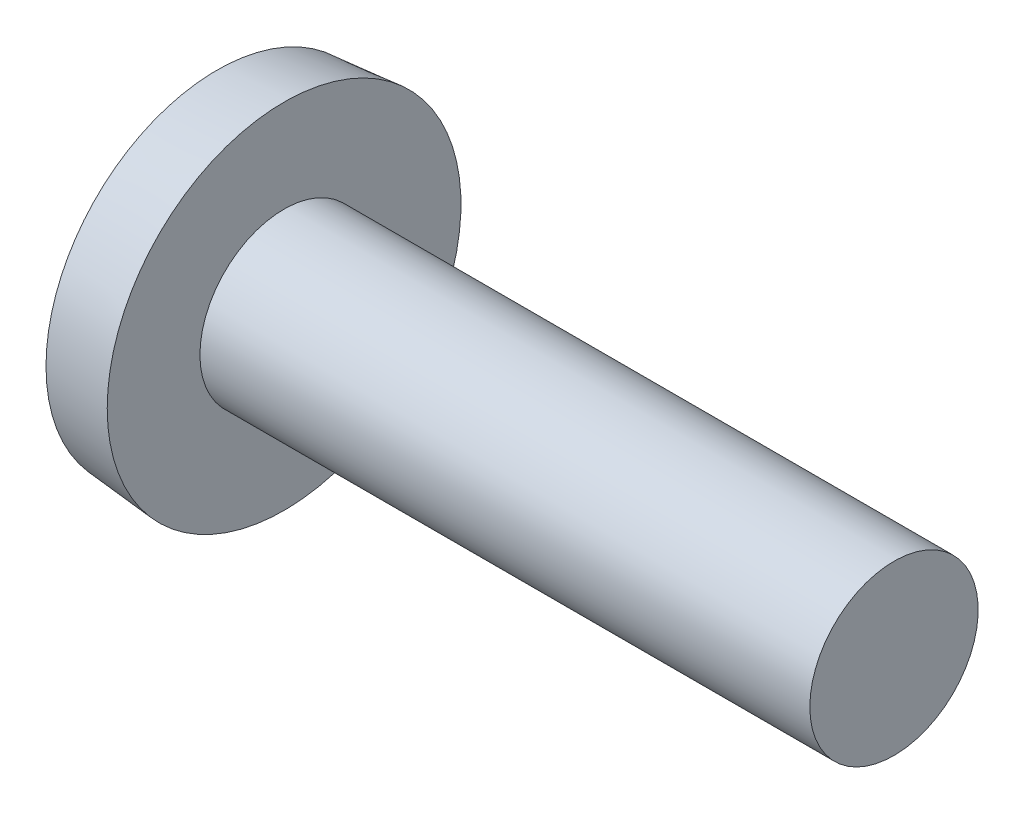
ISO-10303-21;
HEADER;
FILE_DESCRIPTION(('STEP AP214'),'2;1');
FILE_NAME('part.step','',(''),(''),'','','');
FILE_SCHEMA(('AUTOMOTIVE_DESIGN { 1 0 10303 214 1 1 1 1 }'));
ENDSEC;
DATA;
#1=APPLICATION_CONTEXT('core data for automotive mechanical design processes');
#2=APPLICATION_PROTOCOL_DEFINITION('international standard','automotive_design',2000,#1);
#3=PRODUCT_CONTEXT('',#1,'mechanical');
#4=PRODUCT('Part','Part','',(#3));
#5=PRODUCT_RELATED_PRODUCT_CATEGORY('part','',(#4));
#6=PRODUCT_DEFINITION_FORMATION('','',#4);
#7=PRODUCT_DEFINITION_CONTEXT('part definition',#1,'design');
#8=PRODUCT_DEFINITION('design','',#6,#7);
#9=PRODUCT_DEFINITION_SHAPE('','',#8);
#10=(LENGTH_UNIT() NAMED_UNIT(*) SI_UNIT(.MILLI.,.METRE.));
#11=(NAMED_UNIT(*) PLANE_ANGLE_UNIT() SI_UNIT($,.RADIAN.));
#12=(NAMED_UNIT(*) SI_UNIT($,.STERADIAN.) SOLID_ANGLE_UNIT());
#13=UNCERTAINTY_MEASURE_WITH_UNIT(LENGTH_MEASURE(1.E-05),#10,'distance_accuracy_value','');
#14=(GEOMETRIC_REPRESENTATION_CONTEXT(3) GLOBAL_UNCERTAINTY_ASSIGNED_CONTEXT((#13)) GLOBAL_UNIT_ASSIGNED_CONTEXT((#10,
#11,#12)) REPRESENTATION_CONTEXT('',''));
#15=CARTESIAN_POINT('',(0.,0.,0.));
#16=DIRECTION('',(0.,0.,1.));
#17=DIRECTION('',(1.,0.,0.));
#18=AXIS2_PLACEMENT_3D('',#15,#16,#17);
#19=CARTESIAN_POINT('',(8.20606927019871,0.,0.));
#20=DIRECTION('',(-1.,0.,0.));
#21=DIRECTION('',(0.,1.,0.));
#22=AXIS2_PLACEMENT_3D('',#19,#20,#21);
#23=SPHERICAL_SURFACE('',#22,8.20606927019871);
#24=CARTESIAN_POINT('',(0.812800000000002,0.,0.));
#25=DIRECTION('',(-1.,0.,0.));
#26=DIRECTION('',(0.,0.,1.));
#27=AXIS2_PLACEMENT_3D('',#24,#25,#26);
#28=CIRCLE('',#27,3.56077833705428);
#29=CARTESIAN_POINT('',(0.812800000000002,0.,3.56077833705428));
#30=VERTEX_POINT('',#29);
#31=EDGE_CURVE('E153',#30,#30,#28,.T.);
#32=ORIENTED_EDGE('',*,*,#31,.T.);
#33=EDGE_LOOP('',(#32));
#34=FACE_BOUND('',#33,.T.);
#35=CARTESIAN_POINT('',(8.1856609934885,0.,-0.230247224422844));
#36=DIRECTION('',(-0.0882902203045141,0.,-0.996094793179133));
#37=DIRECTION('',(-0.996094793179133,0.,0.0882902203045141));
#38=AXIS2_PLACEMENT_3D('',#35,#36,#37);
#39=CIRCLE('',#38,8.20281308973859);
#40=CARTESIAN_POINT('',(0.307300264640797,2.17484229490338,0.468062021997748));
#41=VERTEX_POINT('',#40);
#42=CARTESIAN_POINT('',(0.0296324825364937,0.492673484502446,0.492673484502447));
#43=VERTEX_POINT('',#42);
#44=EDGE_CURVE('E119',#41,#43,#39,.F.);
#45=ORIENTED_EDGE('',*,*,#44,.T.);
#46=CARTESIAN_POINT('',(8.1856609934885,-0.230247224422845,0.));
#47=DIRECTION('',(-0.0882902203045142,-0.996094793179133,0.));
#48=DIRECTION('',(0.996094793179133,-0.0882902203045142,0.));
#49=AXIS2_PLACEMENT_3D('',#46,#47,#48);
#50=CIRCLE('',#49,8.20281308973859);
#51=CARTESIAN_POINT('',(0.307300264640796,0.46806202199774,2.17484229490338));
#52=VERTEX_POINT('',#51);
#53=EDGE_CURVE('E100',#43,#52,#50,.F.);
#54=ORIENTED_EDGE('',*,*,#53,.T.);
#55=CARTESIAN_POINT('',(6.29513113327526,0.,-2.46572662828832));
#56=DIRECTION('',(0.612571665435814,0.,0.790415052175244));
#57=DIRECTION('',(0.790415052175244,0.,-0.612571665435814));
#58=AXIS2_PLACEMENT_3D('',#55,#56,#57);
#59=CIRCLE('',#58,7.58999871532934);
#60=CARTESIAN_POINT('',(0.307300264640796,-0.468062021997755,2.17484229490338));
#61=VERTEX_POINT('',#60);
#62=EDGE_CURVE('E111',#61,#52,#59,.F.);
#63=ORIENTED_EDGE('',*,*,#62,.F.);
#64=CARTESIAN_POINT('',(8.1856609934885,0.230247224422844,0.));
#65=DIRECTION('',(-0.0882902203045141,0.996094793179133,0.));
#66=DIRECTION('',(-0.996094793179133,-0.0882902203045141,0.));
#67=AXIS2_PLACEMENT_3D('',#64,#65,#66);
#68=CIRCLE('',#67,8.20281308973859);
#69=CARTESIAN_POINT('',(0.0296324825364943,-0.492673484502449,0.492673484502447));
#70=VERTEX_POINT('',#69);
#71=EDGE_CURVE('E188',#61,#70,#68,.F.);
#72=ORIENTED_EDGE('',*,*,#71,.T.);
#73=CARTESIAN_POINT('',(0.307300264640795,-2.17484229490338,0.468062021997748));
#74=VERTEX_POINT('',#73);
#75=EDGE_CURVE('E161',#70,#74,#39,.F.);
#76=ORIENTED_EDGE('',*,*,#75,.T.);
#77=CARTESIAN_POINT('',(6.29513113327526,2.46572662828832,0.));
#78=DIRECTION('',(0.612571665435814,-0.790415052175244,0.));
#79=DIRECTION('',(0.790415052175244,0.612571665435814,0.));
#80=AXIS2_PLACEMENT_3D('',#77,#78,#79);
#81=CIRCLE('',#80,7.58999871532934);
#82=CARTESIAN_POINT('',(0.307300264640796,-2.17484229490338,-0.468062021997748));
#83=VERTEX_POINT('',#82);
#84=EDGE_CURVE('E159',#83,#74,#81,.F.);
#85=ORIENTED_EDGE('',*,*,#84,.F.);
#86=CARTESIAN_POINT('',(8.1856609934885,0.,0.230247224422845));
#87=DIRECTION('',(-0.0882902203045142,0.,0.996094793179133));
#88=DIRECTION('',(0.996094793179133,0.,0.0882902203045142));
#89=AXIS2_PLACEMENT_3D('',#86,#87,#88);
#90=CIRCLE('',#89,8.20281308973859);
#91=CARTESIAN_POINT('',(0.0296324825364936,-0.492673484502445,-0.492673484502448));
#92=VERTEX_POINT('',#91);
#93=EDGE_CURVE('E163',#83,#92,#90,.F.);
#94=ORIENTED_EDGE('',*,*,#93,.T.);
#95=CARTESIAN_POINT('',(0.307300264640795,-0.46806202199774,-2.17484229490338));
#96=VERTEX_POINT('',#95);
#97=EDGE_CURVE('E186',#92,#96,#68,.F.);
#98=ORIENTED_EDGE('',*,*,#97,.T.);
#99=CARTESIAN_POINT('',(6.29513113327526,0.,2.46572662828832));
#100=DIRECTION('',(0.612571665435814,0.,-0.790415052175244));
#101=DIRECTION('',(-0.790415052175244,0.,-0.612571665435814));
#102=AXIS2_PLACEMENT_3D('',#99,#100,#101);
#103=CIRCLE('',#102,7.58999871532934);
#104=CARTESIAN_POINT('',(0.307300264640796,0.468062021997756,-2.17484229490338));
#105=VERTEX_POINT('',#104);
#106=EDGE_CURVE('E112',#105,#96,#103,.F.);
#107=ORIENTED_EDGE('',*,*,#106,.F.);
#108=CARTESIAN_POINT('',(0.0296324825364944,0.492673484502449,-0.492673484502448));
#109=VERTEX_POINT('',#108);
#110=EDGE_CURVE('E135',#105,#109,#50,.F.);
#111=ORIENTED_EDGE('',*,*,#110,.T.);
#112=CARTESIAN_POINT('',(0.307300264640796,2.17484229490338,-0.468062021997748));
#113=VERTEX_POINT('',#112);
#114=EDGE_CURVE('E51',#109,#113,#90,.F.);
#115=ORIENTED_EDGE('',*,*,#114,.T.);
#116=CARTESIAN_POINT('',(6.29513113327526,-2.46572662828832,0.));
#117=DIRECTION('',(0.612571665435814,0.790415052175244,0.));
#118=DIRECTION('',(-0.790415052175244,0.612571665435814,0.));
#119=AXIS2_PLACEMENT_3D('',#116,#117,#118);
#120=CIRCLE('',#119,7.58999871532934);
#121=EDGE_CURVE('E36',#41,#113,#120,.F.);
#122=ORIENTED_EDGE('',*,*,#121,.F.);
#123=EDGE_LOOP('',(#45,#54,#63,#72,#76,#85,#94,#98,#107,#111,#115,#122));
#124=FACE_BOUND('',#123,.T.);
#125=ADVANCED_FACE('F28',(#34,#124),#23,.T.);
#126=CARTESIAN_POINT('',(3.11354838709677,0.,-0.219326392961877));
#127=DIRECTION('',(-0.0882902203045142,0.,0.996094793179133));
#128=DIRECTION('',(0.996094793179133,0.,0.0882902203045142));
#129=AXIS2_PLACEMENT_3D('',#126,#127,#128);
#130=PLANE('',#129);
#131=ORIENTED_EDGE('',*,*,#114,.F.);
#132=DIRECTION('',(0.992234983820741,-0.087948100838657,0.0879481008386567));
#133=VECTOR('',#132,1.);
#134=CARTESIAN_POINT('',(3.13268794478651,0.217629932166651,-0.21762993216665));
#135=LINE('',#134,#133);
#136=CARTESIAN_POINT('',(2.794,0.247650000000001,-0.247649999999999));
#137=VERTEX_POINT('',#136);
#138=EDGE_CURVE('E137',#109,#137,#135,.T.);
#139=ORIENTED_EDGE('',*,*,#138,.T.);
#140=DIRECTION('',(0.788482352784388,-0.611073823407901,0.0698882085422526));
#141=VECTOR('',#140,1.);
#142=CARTESIAN_POINT('',(0.,2.413,-0.4953));
#143=LINE('',#142,#141);
#144=EDGE_CURVE('E121',#113,#137,#143,.T.);
#145=ORIENTED_EDGE('',*,*,#144,.F.);
#146=EDGE_LOOP('',(#131,#139,#145));
#147=FACE_BOUND('',#146,.T.);
#148=ADVANCED_FACE('F167',(#147),#130,.T.);
#149=DIRECTION('',(0.788482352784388,0.611073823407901,0.0698882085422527));
#150=VECTOR('',#149,1.);
#151=CARTESIAN_POINT('',(0.,-2.413,-0.495300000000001));
#152=LINE('',#151,#150);
#153=CARTESIAN_POINT('',(2.794,-0.24765,-0.24765));
#154=VERTEX_POINT('',#153);
#155=EDGE_CURVE('E43',#83,#154,#152,.T.);
#156=ORIENTED_EDGE('',*,*,#155,.T.);
#157=DIRECTION('',(-0.992234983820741,-0.0879481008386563,-0.0879481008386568));
#158=VECTOR('',#157,1.);
#159=CARTESIAN_POINT('',(3.13268794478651,-0.217629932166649,-0.21762993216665));
#160=LINE('',#159,#158);
#161=EDGE_CURVE('E184',#154,#92,#160,.T.);
#162=ORIENTED_EDGE('',*,*,#161,.T.);
#163=ORIENTED_EDGE('',*,*,#93,.F.);
#164=EDGE_LOOP('',(#156,#162,#163));
#165=FACE_BOUND('',#164,.T.);
#166=ADVANCED_FACE('F190',(#165),#130,.T.);
#167=CARTESIAN_POINT('',(3.11354838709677,0.,0.219326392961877));
#168=DIRECTION('',(-0.0882902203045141,0.,-0.996094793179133));
#169=DIRECTION('',(-0.996094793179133,0.,0.0882902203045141));
#170=AXIS2_PLACEMENT_3D('',#167,#168,#169);
#171=PLANE('',#170);
#172=DIRECTION('',(0.788482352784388,-0.611073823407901,-0.0698882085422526));
#173=VECTOR('',#172,1.);
#174=CARTESIAN_POINT('',(0.,2.413,0.4953));
#175=LINE('',#174,#173);
#176=CARTESIAN_POINT('',(2.794,0.247649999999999,0.247650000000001));
#177=VERTEX_POINT('',#176);
#178=EDGE_CURVE('E116',#41,#177,#175,.T.);
#179=ORIENTED_EDGE('',*,*,#178,.T.);
#180=DIRECTION('',(-0.992234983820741,0.0879481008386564,0.0879481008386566));
#181=VECTOR('',#180,1.);
#182=CARTESIAN_POINT('',(3.13268794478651,0.217629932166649,0.21762993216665));
#183=LINE('',#182,#181);
#184=EDGE_CURVE('E11',#177,#43,#183,.T.);
#185=ORIENTED_EDGE('',*,*,#184,.T.);
#186=ORIENTED_EDGE('',*,*,#44,.F.);
#187=EDGE_LOOP('',(#179,#185,#186));
#188=FACE_BOUND('',#187,.T.);
#189=ADVANCED_FACE('F118',(#188),#171,.T.);
#190=ORIENTED_EDGE('',*,*,#75,.F.);
#191=DIRECTION('',(0.992234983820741,0.0879481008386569,-0.0879481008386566));
#192=VECTOR('',#191,1.);
#193=CARTESIAN_POINT('',(3.13268794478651,-0.217629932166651,0.21762993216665));
#194=LINE('',#193,#192);
#195=CARTESIAN_POINT('',(2.794,-0.24765,0.24765));
#196=VERTEX_POINT('',#195);
#197=EDGE_CURVE('E198',#70,#196,#194,.T.);
#198=ORIENTED_EDGE('',*,*,#197,.T.);
#199=DIRECTION('',(0.788482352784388,0.611073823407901,-0.0698882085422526));
#200=VECTOR('',#199,1.);
#201=CARTESIAN_POINT('',(0.,-2.413,0.4953));
#202=LINE('',#201,#200);
#203=EDGE_CURVE('E142',#74,#196,#202,.T.);
#204=ORIENTED_EDGE('',*,*,#203,.F.);
#205=EDGE_LOOP('',(#190,#198,#204));
#206=FACE_BOUND('',#205,.T.);
#207=ADVANCED_FACE('F197',(#206),#171,.T.);
#208=CARTESIAN_POINT('',(-25.4,0.,0.));
#209=DIRECTION('',(-1.,0.,0.));
#210=DIRECTION('',(0.,0.,1.));
#211=AXIS2_PLACEMENT_3D('',#208,#209,#210);
#212=CYLINDRICAL_SURFACE('',#211,1.7526);
#213=CARTESIAN_POINT('',(14.9098,0.,0.));
#214=DIRECTION('',(-1.,0.,0.));
#215=DIRECTION('',(0.,0.,1.));
#216=AXIS2_PLACEMENT_3D('',#213,#214,#215);
#217=CIRCLE('',#216,1.7526);
#218=CARTESIAN_POINT('',(14.9098,0.,1.7526));
#219=VERTEX_POINT('',#218);
#220=EDGE_CURVE('E156',#219,#219,#217,.T.);
#221=ORIENTED_EDGE('',*,*,#220,.T.);
#222=EDGE_LOOP('',(#221));
#223=FACE_BOUND('',#222,.T.);
#224=CARTESIAN_POINT('',(2.2098,0.,0.));
#225=DIRECTION('',(-1.,0.,0.));
#226=DIRECTION('',(0.,0.,1.));
#227=AXIS2_PLACEMENT_3D('',#224,#225,#226);
#228=CIRCLE('',#227,1.7526);
#229=CARTESIAN_POINT('',(2.2098,0.,1.7526));
#230=VERTEX_POINT('',#229);
#231=EDGE_CURVE('E146',#230,#230,#228,.T.);
#232=ORIENTED_EDGE('',*,*,#231,.F.);
#233=EDGE_LOOP('',(#232));
#234=FACE_BOUND('',#233,.T.);
#235=ADVANCED_FACE('F30',(#223,#234),#212,.T.);
#236=CARTESIAN_POINT('',(14.9098,1.7526,0.));
#237=DIRECTION('',(1.,0.,0.));
#238=DIRECTION('',(0.,0.,-1.));
#239=AXIS2_PLACEMENT_3D('',#236,#237,#238);
#240=PLANE('',#239);
#241=ORIENTED_EDGE('',*,*,#220,.F.);
#242=EDGE_LOOP('',(#241));
#243=FACE_BOUND('',#242,.T.);
#244=ADVANCED_FACE('F228',(#243),#240,.T.);
#245=CARTESIAN_POINT('',(2.2098,0.,0.));
#246=DIRECTION('',(1.,0.,0.));
#247=DIRECTION('',(0.,0.,-1.));
#248=AXIS2_PLACEMENT_3D('',#245,#246,#247);
#249=CONICAL_SURFACE('',#248,3.683,0.0872664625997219);
#250=ORIENTED_EDGE('',*,*,#31,.F.);
#251=EDGE_LOOP('',(#250));
#252=FACE_BOUND('',#251,.T.);
#253=CARTESIAN_POINT('',(2.2098,0.,0.));
#254=DIRECTION('',(-1.,0.,0.));
#255=DIRECTION('',(0.,0.,1.));
#256=AXIS2_PLACEMENT_3D('',#253,#254,#255);
#257=CIRCLE('',#256,3.683);
#258=CARTESIAN_POINT('',(2.2098,0.,3.683));
#259=VERTEX_POINT('',#258);
#260=EDGE_CURVE('E150',#259,#259,#257,.T.);
#261=ORIENTED_EDGE('',*,*,#260,.T.);
#262=EDGE_LOOP('',(#261));
#263=FACE_BOUND('',#262,.T.);
#264=ADVANCED_FACE('F226',(#252,#263),#249,.T.);
#265=CARTESIAN_POINT('',(2.2098,1.7526,0.));
#266=DIRECTION('',(-1.,0.,0.));
#267=DIRECTION('',(0.,0.,1.));
#268=AXIS2_PLACEMENT_3D('',#265,#266,#267);
#269=PLANE('',#268);
#270=ORIENTED_EDGE('',*,*,#260,.F.);
#271=EDGE_LOOP('',(#270));
#272=FACE_BOUND('',#271,.T.);
#273=ORIENTED_EDGE('',*,*,#231,.T.);
#274=EDGE_LOOP('',(#273));
#275=FACE_BOUND('',#274,.T.);
#276=ADVANCED_FACE('F235',(#272,#275),#269,.F.);
#277=CARTESIAN_POINT('',(2.794,0.24765,0.24765));
#278=DIRECTION('',(-1.,0.,0.));
#279=DIRECTION('',(0.,0.,1.));
#280=AXIS2_PLACEMENT_3D('',#277,#278,#279);
#281=PLANE('',#280);
#282=DIRECTION('',(0.,1.,0.));
#283=VECTOR('',#282,1.);
#284=CARTESIAN_POINT('',(2.794,-0.24765,0.24765));
#285=LINE('',#284,#283);
#286=EDGE_CURVE('E108',#196,#177,#285,.T.);
#287=ORIENTED_EDGE('',*,*,#286,.T.);
#288=DIRECTION('',(0.,0.,-1.));
#289=VECTOR('',#288,1.);
#290=CARTESIAN_POINT('',(2.794,0.24765,0.24765));
#291=LINE('',#290,#289);
#292=EDGE_CURVE('E125',#177,#137,#291,.T.);
#293=ORIENTED_EDGE('',*,*,#292,.T.);
#294=DIRECTION('',(0.,-1.,0.));
#295=VECTOR('',#294,1.);
#296=CARTESIAN_POINT('',(2.794,0.24765,-0.24765));
#297=LINE('',#296,#295);
#298=EDGE_CURVE('E130',#137,#154,#297,.T.);
#299=ORIENTED_EDGE('',*,*,#298,.T.);
#300=DIRECTION('',(0.,0.,1.));
#301=VECTOR('',#300,1.);
#302=CARTESIAN_POINT('',(2.794,-0.24765,-0.24765));
#303=LINE('',#302,#301);
#304=EDGE_CURVE('E134',#154,#196,#303,.T.);
#305=ORIENTED_EDGE('',*,*,#304,.T.);
#306=EDGE_LOOP('',(#287,#293,#299,#305));
#307=FACE_BOUND('',#306,.T.);
#308=ADVANCED_FACE('F133',(#307),#281,.T.);
#309=CARTESIAN_POINT('',(0.,2.413,0.4953));
#310=DIRECTION('',(0.612571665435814,0.790415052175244,0.));
#311=DIRECTION('',(-0.790415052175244,0.612571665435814,0.));
#312=AXIS2_PLACEMENT_3D('',#309,#310,#311);
#313=PLANE('',#312);
#314=ORIENTED_EDGE('',*,*,#121,.T.);
#315=ORIENTED_EDGE('',*,*,#144,.T.);
#316=ORIENTED_EDGE('',*,*,#292,.F.);
#317=ORIENTED_EDGE('',*,*,#178,.F.);
#318=EDGE_LOOP('',(#314,#315,#316,#317));
#319=FACE_BOUND('',#318,.T.);
#320=ADVANCED_FACE('F126',(#319),#313,.F.);
#321=CARTESIAN_POINT('',(2.794,-0.24765,-0.24765));
#322=DIRECTION('',(0.612571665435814,-0.790415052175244,0.));
#323=DIRECTION('',(0.790415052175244,0.612571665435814,0.));
#324=AXIS2_PLACEMENT_3D('',#321,#322,#323);
#325=PLANE('',#324);
#326=ORIENTED_EDGE('',*,*,#84,.T.);
#327=ORIENTED_EDGE('',*,*,#203,.T.);
#328=ORIENTED_EDGE('',*,*,#304,.F.);
#329=ORIENTED_EDGE('',*,*,#155,.F.);
#330=EDGE_LOOP('',(#326,#327,#328,#329));
#331=FACE_BOUND('',#330,.T.);
#332=ADVANCED_FACE('F192',(#331),#325,.F.);
#333=CARTESIAN_POINT('',(3.11354838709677,0.219326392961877,0.));
#334=DIRECTION('',(-0.0882902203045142,-0.996094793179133,0.));
#335=DIRECTION('',(0.996094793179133,-0.0882902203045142,0.));
#336=AXIS2_PLACEMENT_3D('',#333,#334,#335);
#337=PLANE('',#336);
#338=ORIENTED_EDGE('',*,*,#184,.F.);
#339=DIRECTION('',(0.788482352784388,-0.0698882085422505,-0.611073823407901));
#340=VECTOR('',#339,1.);
#341=CARTESIAN_POINT('',(0.,0.495299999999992,2.413));
#342=LINE('',#341,#340);
#343=EDGE_CURVE('E98',#52,#177,#342,.T.);
#344=ORIENTED_EDGE('',*,*,#343,.F.);
#345=ORIENTED_EDGE('',*,*,#53,.F.);
#346=EDGE_LOOP('',(#338,#344,#345));
#347=FACE_BOUND('',#346,.T.);
#348=ADVANCED_FACE('F97',(#347),#337,.T.);
#349=CARTESIAN_POINT('',(3.11354838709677,-0.219326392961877,0.));
#350=DIRECTION('',(-0.0882902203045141,0.996094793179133,0.));
#351=DIRECTION('',(-0.996094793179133,-0.0882902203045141,0.));
#352=AXIS2_PLACEMENT_3D('',#349,#350,#351);
#353=PLANE('',#352);
#354=DIRECTION('',(0.788482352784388,0.0698882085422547,-0.611073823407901));
#355=VECTOR('',#354,1.);
#356=CARTESIAN_POINT('',(0.,-0.495300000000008,2.413));
#357=LINE('',#356,#355);
#358=EDGE_CURVE('E113',#61,#196,#357,.T.);
#359=ORIENTED_EDGE('',*,*,#358,.T.);
#360=ORIENTED_EDGE('',*,*,#197,.F.);
#361=ORIENTED_EDGE('',*,*,#71,.F.);
#362=EDGE_LOOP('',(#359,#360,#361));
#363=FACE_BOUND('',#362,.T.);
#364=ADVANCED_FACE('F205',(#363),#353,.T.);
#365=CARTESIAN_POINT('',(0.,-0.495300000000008,2.413));
#366=DIRECTION('',(0.612571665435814,0.,0.790415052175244));
#367=DIRECTION('',(-0.790415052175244,0.,0.612571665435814));
#368=AXIS2_PLACEMENT_3D('',#365,#366,#367);
#369=PLANE('',#368);
#370=ORIENTED_EDGE('',*,*,#62,.T.);
#371=ORIENTED_EDGE('',*,*,#343,.T.);
#372=ORIENTED_EDGE('',*,*,#286,.F.);
#373=ORIENTED_EDGE('',*,*,#358,.F.);
#374=EDGE_LOOP('',(#370,#371,#372,#373));
#375=FACE_BOUND('',#374,.T.);
#376=ADVANCED_FACE('F105',(#375),#369,.F.);
#377=DIRECTION('',(0.788482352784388,-0.0698882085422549,0.611073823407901));
#378=VECTOR('',#377,1.);
#379=CARTESIAN_POINT('',(0.,0.495300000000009,-2.413));
#380=LINE('',#379,#378);
#381=EDGE_CURVE('E175',#105,#137,#380,.T.);
#382=ORIENTED_EDGE('',*,*,#381,.T.);
#383=ORIENTED_EDGE('',*,*,#138,.F.);
#384=ORIENTED_EDGE('',*,*,#110,.F.);
#385=EDGE_LOOP('',(#382,#383,#384));
#386=FACE_BOUND('',#385,.T.);
#387=ADVANCED_FACE('F207',(#386),#337,.T.);
#388=ORIENTED_EDGE('',*,*,#161,.F.);
#389=DIRECTION('',(0.788482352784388,0.0698882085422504,0.611073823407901));
#390=VECTOR('',#389,1.);
#391=CARTESIAN_POINT('',(0.,-0.495299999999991,-2.413));
#392=LINE('',#391,#390);
#393=EDGE_CURVE('E178',#96,#154,#392,.T.);
#394=ORIENTED_EDGE('',*,*,#393,.F.);
#395=ORIENTED_EDGE('',*,*,#97,.F.);
#396=EDGE_LOOP('',(#388,#394,#395));
#397=FACE_BOUND('',#396,.T.);
#398=ADVANCED_FACE('F185',(#397),#353,.T.);
#399=CARTESIAN_POINT('',(2.794,0.247650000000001,-0.247649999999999));
#400=DIRECTION('',(0.612571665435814,0.,-0.790415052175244));
#401=DIRECTION('',(0.790415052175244,0.,0.612571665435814));
#402=AXIS2_PLACEMENT_3D('',#399,#400,#401);
#403=PLANE('',#402);
#404=ORIENTED_EDGE('',*,*,#106,.T.);
#405=ORIENTED_EDGE('',*,*,#393,.T.);
#406=ORIENTED_EDGE('',*,*,#298,.F.);
#407=ORIENTED_EDGE('',*,*,#381,.F.);
#408=EDGE_LOOP('',(#404,#405,#406,#407));
#409=FACE_BOUND('',#408,.T.);
#410=ADVANCED_FACE('F174',(#409),#403,.F.);
#411=CLOSED_SHELL('',(#125,#148,#166,#189,#207,#235,#244,#264,#276,#308,#320,#332,#348,#364,
#376,#387,#398,#410));
#412=MANIFOLD_SOLID_BREP('B2',#411);
#413=ADVANCED_BREP_SHAPE_REPRESENTATION('',(#18,#412),#14);
#414=SHAPE_DEFINITION_REPRESENTATION(#9,#413);
ENDSEC;
END-ISO-10303-21;
